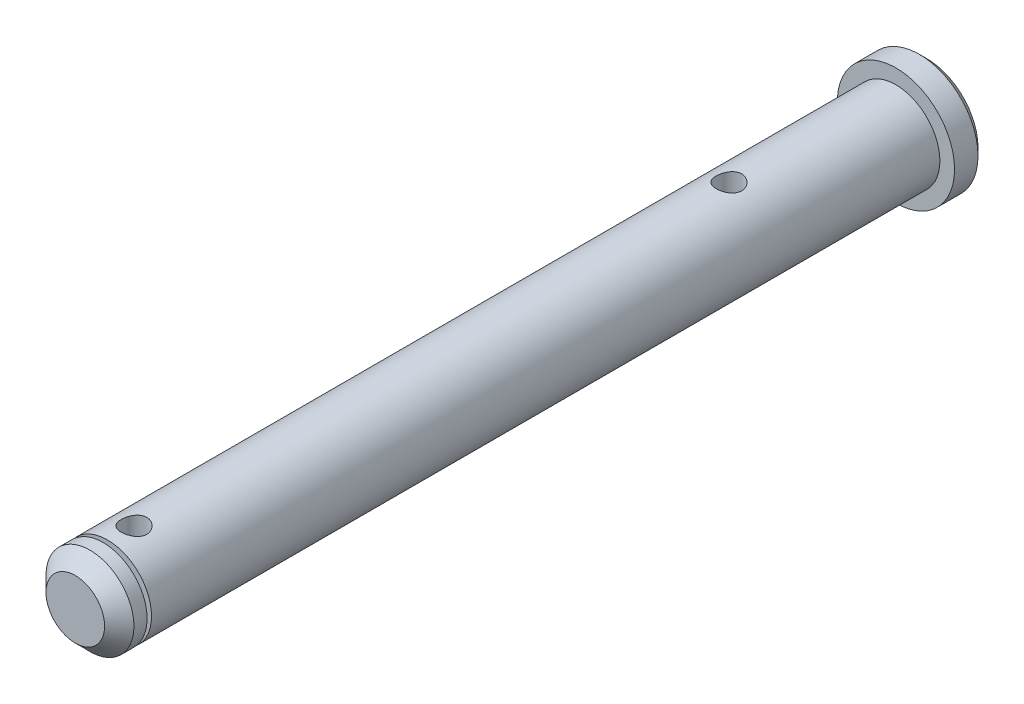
ISO-10303-21;
HEADER;
FILE_DESCRIPTION(('STEP AP214'),'2;1');
FILE_NAME('part.step','',(''),(''),'','','');
FILE_SCHEMA(('AUTOMOTIVE_DESIGN { 1 0 10303 214 1 1 1 1 }'));
ENDSEC;
DATA;
#1=APPLICATION_CONTEXT('core data for automotive mechanical design processes');
#2=APPLICATION_PROTOCOL_DEFINITION('international standard','automotive_design',2000,#1);
#3=PRODUCT_CONTEXT('',#1,'mechanical');
#4=PRODUCT('Part','Part','',(#3));
#5=PRODUCT_RELATED_PRODUCT_CATEGORY('part','',(#4));
#6=PRODUCT_DEFINITION_FORMATION('','',#4);
#7=PRODUCT_DEFINITION_CONTEXT('part definition',#1,'design');
#8=PRODUCT_DEFINITION('design','',#6,#7);
#9=PRODUCT_DEFINITION_SHAPE('','',#8);
#10=(LENGTH_UNIT() NAMED_UNIT(*) SI_UNIT(.MILLI.,.METRE.));
#11=(NAMED_UNIT(*) PLANE_ANGLE_UNIT() SI_UNIT($,.RADIAN.));
#12=(NAMED_UNIT(*) SI_UNIT($,.STERADIAN.) SOLID_ANGLE_UNIT());
#13=UNCERTAINTY_MEASURE_WITH_UNIT(LENGTH_MEASURE(1.E-05),#10,'distance_accuracy_value','');
#14=(GEOMETRIC_REPRESENTATION_CONTEXT(3) GLOBAL_UNCERTAINTY_ASSIGNED_CONTEXT((#13)) GLOBAL_UNIT_ASSIGNED_CONTEXT((#10,
#11,#12)) REPRESENTATION_CONTEXT('',''));
#15=CARTESIAN_POINT('',(0.,0.,0.));
#16=DIRECTION('',(0.,0.,1.));
#17=DIRECTION('',(1.,0.,0.));
#18=AXIS2_PLACEMENT_3D('',#15,#16,#17);
#19=CARTESIAN_POINT('',(0.,0.,58.1));
#20=DIRECTION('',(0.,0.,-1.));
#21=DIRECTION('',(-1.,0.,0.));
#22=AXIS2_PLACEMENT_3D('',#19,#20,#21);
#23=CYLINDRICAL_SURFACE('',#22,3.);
#24=CARTESIAN_POINT('',(0.,0.,2.1));
#25=DIRECTION('',(0.,0.,1.));
#26=DIRECTION('',(1.,0.,0.));
#27=AXIS2_PLACEMENT_3D('',#24,#25,#26);
#28=CIRCLE('',#27,3.);
#29=CARTESIAN_POINT('',(3.,0.,2.1));
#30=VERTEX_POINT('',#29);
#31=EDGE_CURVE('E97',#30,#30,#28,.T.);
#32=ORIENTED_EDGE('',*,*,#31,.T.);
#33=EDGE_LOOP('',(#32));
#34=FACE_BOUND('',#33,.T.);
#35=CARTESIAN_POINT('',(0.,-3.,54.975));
#36=CARTESIAN_POINT('',(-0.0480626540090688,-2.9999994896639,54.974999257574));
#37=CARTESIAN_POINT('',(-0.0961328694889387,-2.9988338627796,54.9710267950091));
#38=CARTESIAN_POINT('',(-0.190877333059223,-2.99429763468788,54.9552771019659));
#39=CARTESIAN_POINT('',(-0.237551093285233,-2.99092627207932,54.9434971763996));
#40=CARTESIAN_POINT('',(-0.328122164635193,-2.98234868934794,54.9125564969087));
#41=CARTESIAN_POINT('',(-0.372023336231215,-2.97714508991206,54.8934062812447));
#42=CARTESIAN_POINT('',(-0.455991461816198,-2.96544622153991,54.8483107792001));
#43=CARTESIAN_POINT('',(-0.496057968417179,-2.95895080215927,54.8223647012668));
#44=CARTESIAN_POINT('',(-0.572312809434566,-2.94516512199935,54.7636674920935));
#45=CARTESIAN_POINT('',(-0.608381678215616,-2.93785925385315,54.7307648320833));
#46=CARTESIAN_POINT('',(-0.674575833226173,-2.92337099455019,54.6594116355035));
#47=CARTESIAN_POINT('',(-0.704700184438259,-2.91618862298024,54.6209602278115));
#48=CARTESIAN_POINT('',(-0.758766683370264,-2.9025969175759,54.5386051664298));
#49=CARTESIAN_POINT('',(-0.782565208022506,-2.89620705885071,54.4946037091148));
#50=CARTESIAN_POINT('',(-0.822376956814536,-2.88515615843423,54.4030069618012));
#51=CARTESIAN_POINT('',(-0.838391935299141,-2.88049472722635,54.3554124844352));
#52=CARTESIAN_POINT('',(-0.861755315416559,-2.87359072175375,54.2593176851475));
#53=CARTESIAN_POINT('',(-0.869323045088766,-2.87128706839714,54.2108751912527));
#54=CARTESIAN_POINT('',(-0.876261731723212,-2.86917752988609,54.1133576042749));
#55=CARTESIAN_POINT('',(-0.875634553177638,-2.86937107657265,54.0642826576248));
#56=CARTESIAN_POINT('',(-0.866373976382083,-2.87217979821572,53.9686576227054));
#57=CARTESIAN_POINT('',(-0.858012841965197,-2.87471261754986,53.922078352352));
#58=CARTESIAN_POINT('',(-0.833960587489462,-2.88178162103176,53.8310145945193));
#59=CARTESIAN_POINT('',(-0.818268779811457,-2.88631799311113,53.7865303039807));
#60=CARTESIAN_POINT('',(-0.779794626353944,-2.89695040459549,53.7002420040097));
#61=CARTESIAN_POINT('',(-0.756922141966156,-2.90306608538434,53.658480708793));
#62=CARTESIAN_POINT('',(-0.704798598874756,-2.91615830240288,53.5792966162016));
#63=CARTESIAN_POINT('',(-0.675546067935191,-2.92313503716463,53.5418748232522));
#64=CARTESIAN_POINT('',(-0.61013020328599,-2.93749957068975,53.4708846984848));
#65=CARTESIAN_POINT('',(-0.573740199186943,-2.94489274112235,53.4375259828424));
#66=CARTESIAN_POINT('',(-0.495790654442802,-2.95901306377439,53.3773372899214));
#67=CARTESIAN_POINT('',(-0.454230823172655,-2.96574017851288,53.3505076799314));
#68=CARTESIAN_POINT('',(-0.366755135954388,-2.97782626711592,53.3040208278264));
#69=CARTESIAN_POINT('',(-0.320814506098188,-2.98317673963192,53.2844078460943));
#70=CARTESIAN_POINT('',(-0.226094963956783,-2.99184543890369,53.2532474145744));
#71=CARTESIAN_POINT('',(-0.17731680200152,-2.99516420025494,53.2416978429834));
#72=CARTESIAN_POINT('',(-0.0800905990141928,-2.99931194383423,53.2273358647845));
#73=CARTESIAN_POINT('',(-0.0316879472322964,-3.00022191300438,53.2242391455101));
#74=CARTESIAN_POINT('',(0.0649474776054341,-2.99968590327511,53.2260769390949));
#75=CARTESIAN_POINT('',(0.11318027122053,-2.99824022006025,53.2310104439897));
#76=CARTESIAN_POINT('',(0.207048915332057,-2.99320820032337,53.2485377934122));
#77=CARTESIAN_POINT('',(0.252718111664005,-2.98966776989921,53.260967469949));
#78=CARTESIAN_POINT('',(0.341314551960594,-2.98085358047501,53.2929386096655));
#79=CARTESIAN_POINT('',(0.384241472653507,-2.97557961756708,53.3124809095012));
#80=CARTESIAN_POINT('',(0.467196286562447,-2.96370103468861,53.3586126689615));
#81=CARTESIAN_POINT('',(0.507138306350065,-2.95706939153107,53.3853494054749));
#82=CARTESIAN_POINT('',(0.58206648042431,-2.94323847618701,53.4449305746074));
#83=CARTESIAN_POINT('',(0.617051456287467,-2.93603906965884,53.4777764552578));
#84=CARTESIAN_POINT('',(0.682310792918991,-2.92157641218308,53.5499776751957));
#85=CARTESIAN_POINT('',(0.712383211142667,-2.91431939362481,53.5895171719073));
#86=CARTESIAN_POINT('',(0.765477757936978,-2.90082694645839,53.6732384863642));
#87=CARTESIAN_POINT('',(0.788500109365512,-2.89459148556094,53.7174201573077));
#88=CARTESIAN_POINT('',(0.826676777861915,-2.88392074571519,53.8090045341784));
#89=CARTESIAN_POINT('',(0.841870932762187,-2.8794763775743,53.8563895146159));
#90=CARTESIAN_POINT('',(0.864024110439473,-2.87290765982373,53.9531977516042));
#91=CARTESIAN_POINT('',(0.870985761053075,-2.87078256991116,54.0026203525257));
#92=CARTESIAN_POINT('',(0.876304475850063,-2.86916315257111,54.1000112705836));
#93=CARTESIAN_POINT('',(0.874989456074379,-2.86956856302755,54.1479602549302));
#94=CARTESIAN_POINT('',(0.864569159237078,-2.87272504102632,54.242921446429));
#95=CARTESIAN_POINT('',(0.855464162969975,-2.87547602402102,54.2899336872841));
#96=CARTESIAN_POINT('',(0.829928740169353,-2.8829483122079,54.3811830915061));
#97=CARTESIAN_POINT('',(0.813580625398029,-2.88764744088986,54.4254452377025));
#98=CARTESIAN_POINT('',(0.774086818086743,-2.89848357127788,54.5106336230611));
#99=CARTESIAN_POINT('',(0.750939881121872,-2.90462083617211,54.5515592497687));
#100=CARTESIAN_POINT('',(0.697565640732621,-2.91790717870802,54.6304460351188));
#101=CARTESIAN_POINT('',(0.667120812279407,-2.92508394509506,54.6682553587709));
#102=CARTESIAN_POINT('',(0.600412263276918,-2.9395012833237,54.7383348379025));
#103=CARTESIAN_POINT('',(0.564147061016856,-2.94674187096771,54.7706035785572));
#104=CARTESIAN_POINT('',(0.485642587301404,-2.96070619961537,54.8295547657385));
#105=CARTESIAN_POINT('',(0.443268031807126,-2.96741061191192,54.856062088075));
#106=CARTESIAN_POINT('',(0.354468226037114,-2.97932100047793,54.9015376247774));
#107=CARTESIAN_POINT('',(0.308045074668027,-2.98452774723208,54.9205097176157));
#108=CARTESIAN_POINT('',(0.218302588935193,-2.99234364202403,54.948470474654));
#109=CARTESIAN_POINT('',(0.175293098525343,-2.99519180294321,54.9583931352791));
#110=CARTESIAN_POINT('',(0.0881910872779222,-2.99902007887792,54.9716577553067));
#111=CARTESIAN_POINT('',(0.0440987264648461,-3.00000046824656,54.975000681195));
#112=CARTESIAN_POINT('',(0.,-3.,54.975));
#113=B_SPLINE_CURVE_WITH_KNOTS('',3,(#35,#36,#37,#38,#39,#40,#41,#42,#43,#44,#45,#46,#47,#48,
#49,#50,#51,#52,#53,#54,#55,#56,#57,#58,#59,#60,#61,#62,#63,#64,#65,#66,#67,#68,#69,#70,#71,#72,
#73,#74,#75,#76,#77,#78,#79,#80,#81,#82,#83,#84,#85,#86,#87,#88,#89,#90,#91,#92,#93,#94,#95,#96,
#97,#98,#99,#100,#101,#102,#103,#104,#105,#106,#107,#108,#109,#110,#111,#112),.UNSPECIFIED.,.T.,
.F.,(4,2,2,2,2,2,2,2,2,2,2,2,2,2,2,2,2,2,2,2,2,2,2,2,2,2,2,2,2,2,2,2,2,2,2,2,2,2,4),(0.,
0.144026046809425,0.288101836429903,0.431972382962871,0.575859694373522,0.723282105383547,
0.870727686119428,1.02127975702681,1.17179787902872,1.31830974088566,1.46478826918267,
1.6062987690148,1.7478225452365,1.89119912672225,2.03460882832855,2.1836624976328,
2.33272454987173,2.48268615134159,2.63260827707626,2.77742173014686,2.9222170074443,
3.06395087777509,3.20570142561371,3.35060941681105,3.49555179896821,3.64544957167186,
3.79534260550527,3.94446510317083,4.09353998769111,4.23674683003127,4.37994851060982,
4.52156297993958,4.66320338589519,4.80975114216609,4.95633626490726,5.10689458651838,
5.25737531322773,5.38954234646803,5.52168996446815),.UNSPECIFIED.);
#114=CARTESIAN_POINT('',(0.,-3.,54.975));
#115=VERTEX_POINT('',#114);
#116=EDGE_CURVE('E88',#115,#115,#113,.T.);
#117=ORIENTED_EDGE('',*,*,#116,.F.);
#118=EDGE_LOOP('',(#117));
#119=FACE_BOUND('',#118,.T.);
#120=CARTESIAN_POINT('',(0.,3.,54.975));
#121=CARTESIAN_POINT('',(0.0480626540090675,2.9999994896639,54.974999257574));
#122=CARTESIAN_POINT('',(0.0961328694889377,2.9988338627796,54.9710267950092));
#123=CARTESIAN_POINT('',(0.190877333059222,2.99429763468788,54.9552771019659));
#124=CARTESIAN_POINT('',(0.237551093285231,2.99092627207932,54.9434971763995));
#125=CARTESIAN_POINT('',(0.328122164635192,2.98234868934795,54.9125564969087));
#126=CARTESIAN_POINT('',(0.372023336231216,2.97714508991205,54.8934062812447));
#127=CARTESIAN_POINT('',(0.4559914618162,2.96544622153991,54.8483107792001));
#128=CARTESIAN_POINT('',(0.496057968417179,2.95895080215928,54.8223647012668));
#129=CARTESIAN_POINT('',(0.572312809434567,2.94516512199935,54.7636674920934));
#130=CARTESIAN_POINT('',(0.608381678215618,2.93785925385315,54.7307648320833));
#131=CARTESIAN_POINT('',(0.674575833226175,2.92337099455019,54.6594116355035));
#132=CARTESIAN_POINT('',(0.704700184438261,2.91618862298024,54.6209602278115));
#133=CARTESIAN_POINT('',(0.758766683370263,2.9025969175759,54.5386051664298));
#134=CARTESIAN_POINT('',(0.782565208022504,2.89620705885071,54.4946037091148));
#135=CARTESIAN_POINT('',(0.822376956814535,2.88515615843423,54.4030069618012));
#136=CARTESIAN_POINT('',(0.83839193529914,2.88049472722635,54.3554124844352));
#137=CARTESIAN_POINT('',(0.861755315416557,2.87359072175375,54.2593176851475));
#138=CARTESIAN_POINT('',(0.869323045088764,2.87128706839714,54.2108751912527));
#139=CARTESIAN_POINT('',(0.876261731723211,2.86917752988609,54.1133576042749));
#140=CARTESIAN_POINT('',(0.875634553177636,2.86937107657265,54.0642826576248));
#141=CARTESIAN_POINT('',(0.866373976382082,2.87217979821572,53.9686576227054));
#142=CARTESIAN_POINT('',(0.858012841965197,2.87471261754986,53.922078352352));
#143=CARTESIAN_POINT('',(0.833960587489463,2.88178162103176,53.8310145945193));
#144=CARTESIAN_POINT('',(0.818268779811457,2.88631799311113,53.7865303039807));
#145=CARTESIAN_POINT('',(0.779794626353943,2.8969504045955,53.7002420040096));
#146=CARTESIAN_POINT('',(0.756922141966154,2.90306608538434,53.658480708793));
#147=CARTESIAN_POINT('',(0.704798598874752,2.91615830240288,53.5792966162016));
#148=CARTESIAN_POINT('',(0.675546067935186,2.92313503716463,53.5418748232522));
#149=CARTESIAN_POINT('',(0.610130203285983,2.93749957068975,53.4708846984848));
#150=CARTESIAN_POINT('',(0.573740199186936,2.94489274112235,53.4375259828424));
#151=CARTESIAN_POINT('',(0.495790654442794,2.95901306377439,53.3773372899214));
#152=CARTESIAN_POINT('',(0.454230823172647,2.96574017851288,53.3505076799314));
#153=CARTESIAN_POINT('',(0.366755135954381,2.97782626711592,53.3040208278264));
#154=CARTESIAN_POINT('',(0.320814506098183,2.98317673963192,53.2844078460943));
#155=CARTESIAN_POINT('',(0.226094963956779,2.99184543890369,53.2532474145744));
#156=CARTESIAN_POINT('',(0.177316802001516,2.99516420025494,53.2416978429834));
#157=CARTESIAN_POINT('',(0.0800905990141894,2.99931194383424,53.2273358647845));
#158=CARTESIAN_POINT('',(0.0316879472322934,3.00022191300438,53.2242391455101));
#159=CARTESIAN_POINT('',(-0.0649474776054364,2.99968590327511,53.2260769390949));
#160=CARTESIAN_POINT('',(-0.113180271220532,2.99824022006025,53.2310104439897));
#161=CARTESIAN_POINT('',(-0.207048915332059,2.99320820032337,53.2485377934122));
#162=CARTESIAN_POINT('',(-0.252718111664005,2.98966776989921,53.260967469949));
#163=CARTESIAN_POINT('',(-0.341314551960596,2.98085358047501,53.2929386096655));
#164=CARTESIAN_POINT('',(-0.38424147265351,2.97557961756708,53.3124809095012));
#165=CARTESIAN_POINT('',(-0.467196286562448,2.96370103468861,53.3586126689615));
#166=CARTESIAN_POINT('',(-0.507138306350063,2.95706939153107,53.3853494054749));
#167=CARTESIAN_POINT('',(-0.582066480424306,2.94323847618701,53.4449305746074));
#168=CARTESIAN_POINT('',(-0.617051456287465,2.93603906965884,53.4777764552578));
#169=CARTESIAN_POINT('',(-0.68231079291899,2.92157641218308,53.5499776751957));
#170=CARTESIAN_POINT('',(-0.712383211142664,2.91431939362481,53.5895171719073));
#171=CARTESIAN_POINT('',(-0.765477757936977,2.90082694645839,53.6732384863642));
#172=CARTESIAN_POINT('',(-0.788500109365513,2.89459148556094,53.7174201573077));
#173=CARTESIAN_POINT('',(-0.826676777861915,2.88392074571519,53.8090045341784));
#174=CARTESIAN_POINT('',(-0.841870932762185,2.87947637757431,53.8563895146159));
#175=CARTESIAN_POINT('',(-0.864024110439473,2.87290765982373,53.9531977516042));
#176=CARTESIAN_POINT('',(-0.870985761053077,2.87078256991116,54.0026203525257));
#177=CARTESIAN_POINT('',(-0.876304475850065,2.86916315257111,54.1000112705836));
#178=CARTESIAN_POINT('',(-0.874989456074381,2.86956856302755,54.1479602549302));
#179=CARTESIAN_POINT('',(-0.86456915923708,2.87272504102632,54.242921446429));
#180=CARTESIAN_POINT('',(-0.855464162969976,2.87547602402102,54.2899336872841));
#181=CARTESIAN_POINT('',(-0.829928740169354,2.8829483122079,54.3811830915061));
#182=CARTESIAN_POINT('',(-0.81358062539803,2.88764744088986,54.4254452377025));
#183=CARTESIAN_POINT('',(-0.774086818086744,2.89848357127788,54.5106336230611));
#184=CARTESIAN_POINT('',(-0.750939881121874,2.90462083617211,54.5515592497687));
#185=CARTESIAN_POINT('',(-0.697565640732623,2.91790717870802,54.6304460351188));
#186=CARTESIAN_POINT('',(-0.667120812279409,2.92508394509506,54.6682553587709));
#187=CARTESIAN_POINT('',(-0.600412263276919,2.9395012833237,54.7383348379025));
#188=CARTESIAN_POINT('',(-0.564147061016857,2.94674187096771,54.7706035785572));
#189=CARTESIAN_POINT('',(-0.485642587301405,2.96070619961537,54.8295547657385));
#190=CARTESIAN_POINT('',(-0.443268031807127,2.96741061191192,54.856062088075));
#191=CARTESIAN_POINT('',(-0.354468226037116,2.97932100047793,54.9015376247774));
#192=CARTESIAN_POINT('',(-0.308045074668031,2.98452774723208,54.9205097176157));
#193=CARTESIAN_POINT('',(-0.218302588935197,2.99234364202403,54.948470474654));
#194=CARTESIAN_POINT('',(-0.175293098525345,2.99519180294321,54.9583931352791));
#195=CARTESIAN_POINT('',(-0.0881910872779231,2.99902007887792,54.9716577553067));
#196=CARTESIAN_POINT('',(-0.0440987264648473,3.00000046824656,54.975000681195));
#197=CARTESIAN_POINT('',(0.,3.,54.975));
#198=B_SPLINE_CURVE_WITH_KNOTS('',3,(#120,#121,#122,#123,#124,#125,#126,#127,#128,#129,#130,
#131,#132,#133,#134,#135,#136,#137,#138,#139,#140,#141,#142,#143,#144,#145,#146,#147,#148,#149,
#150,#151,#152,#153,#154,#155,#156,#157,#158,#159,#160,#161,#162,#163,#164,#165,#166,#167,#168,
#169,#170,#171,#172,#173,#174,#175,#176,#177,#178,#179,#180,#181,#182,#183,#184,#185,#186,#187,
#188,#189,#190,#191,#192,#193,#194,#195,#196,#197),.UNSPECIFIED.,.T.,.F.,(4,2,2,2,2,2,2,2,2,2,2,
2,2,2,2,2,2,2,2,2,2,2,2,2,2,2,2,2,2,2,2,2,2,2,2,2,2,2,4),(0.,0.144026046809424,
0.288101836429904,0.431972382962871,0.575859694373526,0.723282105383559,0.870727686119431,
1.0212797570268,1.17179787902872,1.31830974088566,1.46478826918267,1.60629876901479,
1.74782254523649,1.89119912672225,2.03460882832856,2.18366249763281,2.33272454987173,
2.48268615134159,2.63260827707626,2.77742173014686,2.9222170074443,3.0639508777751,
3.20570142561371,3.35060941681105,3.4955517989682,3.64544957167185,3.79534260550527,
3.94446510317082,4.09353998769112,4.23674683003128,4.37994851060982,4.52156297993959,
4.66320338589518,4.80975114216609,4.95633626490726,5.10689458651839,5.25737531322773,
5.38954234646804,5.52168996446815),.UNSPECIFIED.);
#199=CARTESIAN_POINT('',(0.,3.,54.975));
#200=VERTEX_POINT('',#199);
#201=EDGE_CURVE('E60',#200,#200,#198,.T.);
#202=ORIENTED_EDGE('',*,*,#201,.F.);
#203=EDGE_LOOP('',(#202));
#204=FACE_BOUND('',#203,.T.);
#205=CARTESIAN_POINT('',(0.,-3.,14.375));
#206=CARTESIAN_POINT('',(-0.0480626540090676,-2.9999994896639,14.374999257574));
#207=CARTESIAN_POINT('',(-0.0961328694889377,-2.9988338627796,14.3710267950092));
#208=CARTESIAN_POINT('',(-0.190877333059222,-2.99429763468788,14.3552771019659));
#209=CARTESIAN_POINT('',(-0.237551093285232,-2.99092627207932,14.3434971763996));
#210=CARTESIAN_POINT('',(-0.328122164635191,-2.98234868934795,14.3125564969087));
#211=CARTESIAN_POINT('',(-0.372023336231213,-2.97714508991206,14.2934062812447));
#212=CARTESIAN_POINT('',(-0.455991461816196,-2.96544622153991,14.2483107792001));
#213=CARTESIAN_POINT('',(-0.496057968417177,-2.95895080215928,14.2223647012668));
#214=CARTESIAN_POINT('',(-0.572312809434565,-2.94516512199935,14.1636674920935));
#215=CARTESIAN_POINT('',(-0.608381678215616,-2.93785925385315,14.1307648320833));
#216=CARTESIAN_POINT('',(-0.674575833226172,-2.92337099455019,14.0594116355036));
#217=CARTESIAN_POINT('',(-0.704700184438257,-2.91618862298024,14.0209602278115));
#218=CARTESIAN_POINT('',(-0.75876668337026,-2.9025969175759,13.9386051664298));
#219=CARTESIAN_POINT('',(-0.782565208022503,-2.89620705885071,13.8946037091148));
#220=CARTESIAN_POINT('',(-0.822376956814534,-2.88515615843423,13.8030069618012));
#221=CARTESIAN_POINT('',(-0.83839193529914,-2.88049472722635,13.7554124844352));
#222=CARTESIAN_POINT('',(-0.861755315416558,-2.87359072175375,13.6593176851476));
#223=CARTESIAN_POINT('',(-0.869323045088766,-2.87128706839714,13.6108751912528));
#224=CARTESIAN_POINT('',(-0.876261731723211,-2.86917752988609,13.5133576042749));
#225=CARTESIAN_POINT('',(-0.875634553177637,-2.86937107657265,13.4642826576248));
#226=CARTESIAN_POINT('',(-0.866373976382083,-2.87217979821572,13.3686576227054));
#227=CARTESIAN_POINT('',(-0.858012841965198,-2.87471261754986,13.322078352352));
#228=CARTESIAN_POINT('',(-0.833960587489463,-2.88178162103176,13.2310145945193));
#229=CARTESIAN_POINT('',(-0.818268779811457,-2.88631799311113,13.1865303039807));
#230=CARTESIAN_POINT('',(-0.779794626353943,-2.8969504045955,13.1002420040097));
#231=CARTESIAN_POINT('',(-0.756922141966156,-2.90306608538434,13.0584807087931));
#232=CARTESIAN_POINT('',(-0.704798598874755,-2.91615830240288,12.9792966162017));
#233=CARTESIAN_POINT('',(-0.675546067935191,-2.92313503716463,12.9418748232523));
#234=CARTESIAN_POINT('',(-0.610130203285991,-2.93749957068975,12.8708846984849));
#235=CARTESIAN_POINT('',(-0.573740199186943,-2.94489274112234,12.8375259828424));
#236=CARTESIAN_POINT('',(-0.495790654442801,-2.95901306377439,12.7773372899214));
#237=CARTESIAN_POINT('',(-0.454230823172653,-2.96574017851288,12.7505076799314));
#238=CARTESIAN_POINT('',(-0.366755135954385,-2.97782626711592,12.7040208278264));
#239=CARTESIAN_POINT('',(-0.320814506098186,-2.98317673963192,12.6844078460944));
#240=CARTESIAN_POINT('',(-0.226094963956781,-2.99184543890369,12.6532474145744));
#241=CARTESIAN_POINT('',(-0.177316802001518,-2.99516420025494,12.6416978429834));
#242=CARTESIAN_POINT('',(-0.08009059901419,-2.99931194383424,12.6273358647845));
#243=CARTESIAN_POINT('',(-0.031687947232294,-3.00022191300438,12.6242391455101));
#244=CARTESIAN_POINT('',(0.0649474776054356,-2.99968590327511,12.6260769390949));
#245=CARTESIAN_POINT('',(0.11318027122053,-2.99824022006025,12.6310104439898));
#246=CARTESIAN_POINT('',(0.207048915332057,-2.99320820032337,12.6485377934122));
#247=CARTESIAN_POINT('',(0.252718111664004,-2.98966776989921,12.660967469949));
#248=CARTESIAN_POINT('',(0.341314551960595,-2.98085358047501,12.6929386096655));
#249=CARTESIAN_POINT('',(0.384241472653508,-2.97557961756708,12.7124809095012));
#250=CARTESIAN_POINT('',(0.467196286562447,-2.96370103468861,12.7586126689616));
#251=CARTESIAN_POINT('',(0.507138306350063,-2.95706939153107,12.7853494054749));
#252=CARTESIAN_POINT('',(0.582066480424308,-2.94323847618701,12.8449305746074));
#253=CARTESIAN_POINT('',(0.617051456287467,-2.93603906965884,12.8777764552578));
#254=CARTESIAN_POINT('',(0.682310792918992,-2.92157641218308,12.9499776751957));
#255=CARTESIAN_POINT('',(0.712383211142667,-2.91431939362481,12.9895171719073));
#256=CARTESIAN_POINT('',(0.76547775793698,-2.90082694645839,13.0732384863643));
#257=CARTESIAN_POINT('',(0.788500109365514,-2.89459148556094,13.1174201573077));
#258=CARTESIAN_POINT('',(0.826676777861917,-2.88392074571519,13.2090045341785));
#259=CARTESIAN_POINT('',(0.841870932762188,-2.8794763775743,13.2563895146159));
#260=CARTESIAN_POINT('',(0.864024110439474,-2.87290765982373,13.3531977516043));
#261=CARTESIAN_POINT('',(0.870985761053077,-2.87078256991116,13.4026203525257));
#262=CARTESIAN_POINT('',(0.876304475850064,-2.86916315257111,13.5000112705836));
#263=CARTESIAN_POINT('',(0.874989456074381,-2.86956856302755,13.5479602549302));
#264=CARTESIAN_POINT('',(0.86456915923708,-2.87272504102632,13.642921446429));
#265=CARTESIAN_POINT('',(0.855464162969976,-2.87547602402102,13.6899336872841));
#266=CARTESIAN_POINT('',(0.829928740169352,-2.8829483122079,13.7811830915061));
#267=CARTESIAN_POINT('',(0.813580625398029,-2.88764744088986,13.8254452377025));
#268=CARTESIAN_POINT('',(0.774086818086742,-2.89848357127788,13.9106336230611));
#269=CARTESIAN_POINT('',(0.750939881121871,-2.90462083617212,13.9515592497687));
#270=CARTESIAN_POINT('',(0.697565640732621,-2.91790717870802,14.0304460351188));
#271=CARTESIAN_POINT('',(0.667120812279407,-2.92508394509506,14.0682553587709));
#272=CARTESIAN_POINT('',(0.600412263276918,-2.9395012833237,14.1383348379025));
#273=CARTESIAN_POINT('',(0.564147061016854,-2.94674187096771,14.1706035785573));
#274=CARTESIAN_POINT('',(0.485642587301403,-2.96070619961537,14.2295547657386));
#275=CARTESIAN_POINT('',(0.443268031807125,-2.96741061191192,14.256062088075));
#276=CARTESIAN_POINT('',(0.354468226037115,-2.97932100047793,14.3015376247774));
#277=CARTESIAN_POINT('',(0.308045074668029,-2.98452774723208,14.3205097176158));
#278=CARTESIAN_POINT('',(0.218302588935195,-2.99234364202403,14.348470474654));
#279=CARTESIAN_POINT('',(0.175293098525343,-2.99519180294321,14.3583931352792));
#280=CARTESIAN_POINT('',(0.0881910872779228,-2.99902007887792,14.3716577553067));
#281=CARTESIAN_POINT('',(0.044098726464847,-3.00000046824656,14.3750006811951));
#282=CARTESIAN_POINT('',(0.,-3.,14.375));
#283=B_SPLINE_CURVE_WITH_KNOTS('',3,(#205,#206,#207,#208,#209,#210,#211,#212,#213,#214,#215,
#216,#217,#218,#219,#220,#221,#222,#223,#224,#225,#226,#227,#228,#229,#230,#231,#232,#233,#234,
#235,#236,#237,#238,#239,#240,#241,#242,#243,#244,#245,#246,#247,#248,#249,#250,#251,#252,#253,
#254,#255,#256,#257,#258,#259,#260,#261,#262,#263,#264,#265,#266,#267,#268,#269,#270,#271,#272,
#273,#274,#275,#276,#277,#278,#279,#280,#281,#282),.UNSPECIFIED.,.T.,.F.,(4,2,2,2,2,2,2,2,2,2,2,
2,2,2,2,2,2,2,2,2,2,2,2,2,2,2,2,2,2,2,2,2,2,2,2,2,2,2,4),(0.,0.144026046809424,
0.288101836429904,0.431972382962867,0.575859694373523,0.72328210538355,0.870727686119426,
1.0212797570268,1.17179787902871,1.31830974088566,1.46478826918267,1.60629876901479,
1.7478225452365,1.89119912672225,2.03460882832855,2.1836624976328,2.33272454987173,
2.48268615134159,2.63260827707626,2.77742173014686,2.9222170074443,3.06395087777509,
3.20570142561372,3.35060941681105,3.49555179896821,3.64544957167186,3.79534260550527,
3.94446510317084,4.09353998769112,4.23674683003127,4.37994851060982,4.52156297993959,
4.66320338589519,4.8097511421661,4.95633626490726,5.10689458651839,5.25737531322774,
5.38954234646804,5.52168996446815),.UNSPECIFIED.);
#284=CARTESIAN_POINT('',(0.,-3.,14.375));
#285=VERTEX_POINT('',#284);
#286=EDGE_CURVE('E61',#285,#285,#283,.T.);
#287=ORIENTED_EDGE('',*,*,#286,.F.);
#288=EDGE_LOOP('',(#287));
#289=FACE_BOUND('',#288,.T.);
#290=CARTESIAN_POINT('',(0.,3.,14.375));
#291=CARTESIAN_POINT('',(0.0480626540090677,2.9999994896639,14.374999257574));
#292=CARTESIAN_POINT('',(0.0961328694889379,2.9988338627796,14.3710267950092));
#293=CARTESIAN_POINT('',(0.190877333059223,2.99429763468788,14.3552771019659));
#294=CARTESIAN_POINT('',(0.237551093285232,2.99092627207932,14.3434971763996));
#295=CARTESIAN_POINT('',(0.328122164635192,2.98234868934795,14.3125564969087));
#296=CARTESIAN_POINT('',(0.372023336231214,2.97714508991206,14.2934062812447));
#297=CARTESIAN_POINT('',(0.455991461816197,2.96544622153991,14.2483107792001));
#298=CARTESIAN_POINT('',(0.496057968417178,2.95895080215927,14.2223647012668));
#299=CARTESIAN_POINT('',(0.572312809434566,2.94516512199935,14.1636674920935));
#300=CARTESIAN_POINT('',(0.608381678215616,2.93785925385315,14.1307648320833));
#301=CARTESIAN_POINT('',(0.674575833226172,2.92337099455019,14.0594116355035));
#302=CARTESIAN_POINT('',(0.704700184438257,2.91618862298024,14.0209602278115));
#303=CARTESIAN_POINT('',(0.758766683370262,2.9025969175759,13.9386051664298));
#304=CARTESIAN_POINT('',(0.782565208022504,2.89620705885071,13.8946037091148));
#305=CARTESIAN_POINT('',(0.822376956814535,2.88515615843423,13.8030069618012));
#306=CARTESIAN_POINT('',(0.83839193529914,2.88049472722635,13.7554124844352));
#307=CARTESIAN_POINT('',(0.861755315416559,2.87359072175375,13.6593176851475));
#308=CARTESIAN_POINT('',(0.869323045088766,2.87128706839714,13.6108751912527));
#309=CARTESIAN_POINT('',(0.876261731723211,2.86917752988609,13.5133576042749));
#310=CARTESIAN_POINT('',(0.875634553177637,2.86937107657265,13.4642826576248));
#311=CARTESIAN_POINT('',(0.866373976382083,2.87217979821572,13.3686576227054));
#312=CARTESIAN_POINT('',(0.858012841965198,2.87471261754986,13.322078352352));
#313=CARTESIAN_POINT('',(0.833960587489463,2.88178162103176,13.2310145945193));
#314=CARTESIAN_POINT('',(0.818268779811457,2.88631799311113,13.1865303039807));
#315=CARTESIAN_POINT('',(0.779794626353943,2.89695040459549,13.1002420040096));
#316=CARTESIAN_POINT('',(0.756922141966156,2.90306608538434,13.058480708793));
#317=CARTESIAN_POINT('',(0.704798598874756,2.91615830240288,12.9792966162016));
#318=CARTESIAN_POINT('',(0.675546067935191,2.92313503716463,12.9418748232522));
#319=CARTESIAN_POINT('',(0.61013020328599,2.93749957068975,12.8708846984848));
#320=CARTESIAN_POINT('',(0.573740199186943,2.94489274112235,12.8375259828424));
#321=CARTESIAN_POINT('',(0.4957906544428,2.95901306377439,12.7773372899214));
#322=CARTESIAN_POINT('',(0.454230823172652,2.96574017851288,12.7505076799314));
#323=CARTESIAN_POINT('',(0.366755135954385,2.97782626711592,12.7040208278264));
#324=CARTESIAN_POINT('',(0.320814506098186,2.98317673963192,12.6844078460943));
#325=CARTESIAN_POINT('',(0.22609496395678,2.99184543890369,12.6532474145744));
#326=CARTESIAN_POINT('',(0.177316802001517,2.99516420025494,12.6416978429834));
#327=CARTESIAN_POINT('',(0.0800905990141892,2.99931194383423,12.6273358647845));
#328=CARTESIAN_POINT('',(0.0316879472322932,3.00022191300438,12.6242391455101));
#329=CARTESIAN_POINT('',(-0.0649474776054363,2.99968590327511,12.6260769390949));
#330=CARTESIAN_POINT('',(-0.113180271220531,2.99824022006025,12.6310104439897));
#331=CARTESIAN_POINT('',(-0.207048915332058,2.99320820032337,12.6485377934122));
#332=CARTESIAN_POINT('',(-0.252718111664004,2.98966776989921,12.660967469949));
#333=CARTESIAN_POINT('',(-0.341314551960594,2.98085358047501,12.6929386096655));
#334=CARTESIAN_POINT('',(-0.384241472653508,2.97557961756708,12.7124809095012));
#335=CARTESIAN_POINT('',(-0.467196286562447,2.96370103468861,12.7586126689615));
#336=CARTESIAN_POINT('',(-0.507138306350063,2.95706939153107,12.7853494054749));
#337=CARTESIAN_POINT('',(-0.582066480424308,2.94323847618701,12.8449305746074));
#338=CARTESIAN_POINT('',(-0.617051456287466,2.93603906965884,12.8777764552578));
#339=CARTESIAN_POINT('',(-0.682310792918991,2.92157641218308,12.9499776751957));
#340=CARTESIAN_POINT('',(-0.712383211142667,2.91431939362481,12.9895171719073));
#341=CARTESIAN_POINT('',(-0.765477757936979,2.90082694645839,13.0732384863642));
#342=CARTESIAN_POINT('',(-0.788500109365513,2.89459148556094,13.1174201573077));
#343=CARTESIAN_POINT('',(-0.826676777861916,2.88392074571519,13.2090045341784));
#344=CARTESIAN_POINT('',(-0.841870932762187,2.8794763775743,13.2563895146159));
#345=CARTESIAN_POINT('',(-0.864024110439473,2.87290765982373,13.3531977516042));
#346=CARTESIAN_POINT('',(-0.870985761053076,2.87078256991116,13.4026203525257));
#347=CARTESIAN_POINT('',(-0.876304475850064,2.86916315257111,13.5000112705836));
#348=CARTESIAN_POINT('',(-0.87498945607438,2.86956856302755,13.5479602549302));
#349=CARTESIAN_POINT('',(-0.86456915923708,2.87272504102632,13.642921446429));
#350=CARTESIAN_POINT('',(-0.855464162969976,2.87547602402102,13.6899336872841));
#351=CARTESIAN_POINT('',(-0.829928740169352,2.8829483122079,13.7811830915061));
#352=CARTESIAN_POINT('',(-0.813580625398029,2.88764744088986,13.8254452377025));
#353=CARTESIAN_POINT('',(-0.774086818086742,2.89848357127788,13.9106336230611));
#354=CARTESIAN_POINT('',(-0.750939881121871,2.90462083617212,13.9515592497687));
#355=CARTESIAN_POINT('',(-0.697565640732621,2.91790717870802,14.0304460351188));
#356=CARTESIAN_POINT('',(-0.667120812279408,2.92508394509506,14.0682553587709));
#357=CARTESIAN_POINT('',(-0.600412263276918,2.9395012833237,14.1383348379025));
#358=CARTESIAN_POINT('',(-0.564147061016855,2.94674187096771,14.1706035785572));
#359=CARTESIAN_POINT('',(-0.485642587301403,2.96070619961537,14.2295547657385));
#360=CARTESIAN_POINT('',(-0.443268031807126,2.96741061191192,14.256062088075));
#361=CARTESIAN_POINT('',(-0.354468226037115,2.97932100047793,14.3015376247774));
#362=CARTESIAN_POINT('',(-0.308045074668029,2.98452774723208,14.3205097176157));
#363=CARTESIAN_POINT('',(-0.218302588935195,2.99234364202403,14.348470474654));
#364=CARTESIAN_POINT('',(-0.175293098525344,2.99519180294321,14.3583931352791));
#365=CARTESIAN_POINT('',(-0.0881910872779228,2.99902007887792,14.3716577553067));
#366=CARTESIAN_POINT('',(-0.044098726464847,3.00000046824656,14.375000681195));
#367=CARTESIAN_POINT('',(0.,3.,14.375));
#368=B_SPLINE_CURVE_WITH_KNOTS('',3,(#290,#291,#292,#293,#294,#295,#296,#297,#298,#299,#300,
#301,#302,#303,#304,#305,#306,#307,#308,#309,#310,#311,#312,#313,#314,#315,#316,#317,#318,#319,
#320,#321,#322,#323,#324,#325,#326,#327,#328,#329,#330,#331,#332,#333,#334,#335,#336,#337,#338,
#339,#340,#341,#342,#343,#344,#345,#346,#347,#348,#349,#350,#351,#352,#353,#354,#355,#356,#357,
#358,#359,#360,#361,#362,#363,#364,#365,#366,#367),.UNSPECIFIED.,.T.,.F.,(4,2,2,2,2,2,2,2,2,2,2,
2,2,2,2,2,2,2,2,2,2,2,2,2,2,2,2,2,2,2,2,2,2,2,2,2,2,2,4),(0.,0.144026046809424,
0.288101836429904,0.431972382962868,0.575859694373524,0.72328210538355,0.870727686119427,
1.0212797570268,1.17179787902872,1.31830974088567,1.46478826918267,1.60629876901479,
1.7478225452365,1.89119912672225,2.03460882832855,2.1836624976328,2.33272454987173,
2.48268615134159,2.63260827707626,2.77742173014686,2.9222170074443,3.06395087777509,
3.20570142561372,3.35060941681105,3.4955517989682,3.64544957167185,3.79534260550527,
3.94446510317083,4.09353998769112,4.23674683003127,4.37994851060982,4.52156297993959,
4.66320338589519,4.8097511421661,4.95633626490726,5.10689458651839,5.25737531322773,
5.38954234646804,5.52168996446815),.UNSPECIFIED.);
#369=CARTESIAN_POINT('',(0.,3.,14.375));
#370=VERTEX_POINT('',#369);
#371=EDGE_CURVE('E52',#370,#370,#368,.T.);
#372=ORIENTED_EDGE('',*,*,#371,.F.);
#373=EDGE_LOOP('',(#372));
#374=FACE_BOUND('',#373,.T.);
#375=CARTESIAN_POINT('',(0.,0.,55.9));
#376=DIRECTION('',(0.,0.,1.));
#377=DIRECTION('',(1.,0.,0.));
#378=AXIS2_PLACEMENT_3D('',#375,#376,#377);
#379=CIRCLE('',#378,3.);
#380=CARTESIAN_POINT('',(3.,0.,55.9));
#381=VERTEX_POINT('',#380);
#382=EDGE_CURVE('E115',#381,#381,#379,.T.);
#383=ORIENTED_EDGE('',*,*,#382,.F.);
#384=EDGE_LOOP('',(#383));
#385=FACE_BOUND('',#384,.T.);
#386=ADVANCED_FACE('F32',(#34,#119,#204,#289,#374,#385),#23,.T.);
#387=CARTESIAN_POINT('',(0.,0.,2.1));
#388=DIRECTION('',(0.,0.,-1.));
#389=DIRECTION('',(-1.,0.,0.));
#390=AXIS2_PLACEMENT_3D('',#387,#388,#389);
#391=CYLINDRICAL_SURFACE('',#390,4.);
#392=CARTESIAN_POINT('',(0.,0.,0.499999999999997));
#393=DIRECTION('',(0.,0.,1.));
#394=DIRECTION('',(1.,0.,0.));
#395=AXIS2_PLACEMENT_3D('',#392,#393,#394);
#396=CIRCLE('',#395,4.);
#397=CARTESIAN_POINT('',(4.,0.,0.499999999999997));
#398=VERTEX_POINT('',#397);
#399=EDGE_CURVE('E47',#398,#398,#396,.T.);
#400=ORIENTED_EDGE('',*,*,#399,.T.);
#401=EDGE_LOOP('',(#400));
#402=FACE_BOUND('',#401,.T.);
#403=CARTESIAN_POINT('',(0.,0.,2.1));
#404=DIRECTION('',(0.,0.,1.));
#405=DIRECTION('',(1.,0.,0.));
#406=AXIS2_PLACEMENT_3D('',#403,#404,#405);
#407=CIRCLE('',#406,4.);
#408=CARTESIAN_POINT('',(4.,0.,2.1));
#409=VERTEX_POINT('',#408);
#410=EDGE_CURVE('E100',#409,#409,#407,.T.);
#411=ORIENTED_EDGE('',*,*,#410,.F.);
#412=EDGE_LOOP('',(#411));
#413=FACE_BOUND('',#412,.T.);
#414=ADVANCED_FACE('F123',(#402,#413),#391,.T.);
#415=CARTESIAN_POINT('',(0.,0.,2.1));
#416=DIRECTION('',(0.,0.,1.));
#417=DIRECTION('',(1.,0.,0.));
#418=AXIS2_PLACEMENT_3D('',#415,#416,#417);
#419=PLANE('',#418);
#420=ORIENTED_EDGE('',*,*,#31,.F.);
#421=EDGE_LOOP('',(#420));
#422=FACE_BOUND('',#421,.T.);
#423=ORIENTED_EDGE('',*,*,#410,.T.);
#424=EDGE_LOOP('',(#423));
#425=FACE_BOUND('',#424,.T.);
#426=ADVANCED_FACE('F127',(#422,#425),#419,.T.);
#427=CARTESIAN_POINT('',(0.,0.,0.));
#428=DIRECTION('',(0.,0.,1.));
#429=DIRECTION('',(1.,0.,0.));
#430=AXIS2_PLACEMENT_3D('',#427,#428,#429);
#431=PLANE('',#430);
#432=CARTESIAN_POINT('',(0.,0.,0.));
#433=DIRECTION('',(0.,0.,1.));
#434=DIRECTION('',(1.,0.,0.));
#435=AXIS2_PLACEMENT_3D('',#432,#433,#434);
#436=CIRCLE('',#435,3.5);
#437=CARTESIAN_POINT('',(3.5,0.,0.));
#438=VERTEX_POINT('',#437);
#439=EDGE_CURVE('E43',#438,#438,#436,.F.);
#440=ORIENTED_EDGE('',*,*,#439,.T.);
#441=EDGE_LOOP('',(#440));
#442=FACE_BOUND('',#441,.T.);
#443=ADVANCED_FACE('F83',(#442),#431,.F.);
#444=CARTESIAN_POINT('',(0.,3.,54.1));
#445=DIRECTION('',(0.,1.,0.));
#446=DIRECTION('',(0.,0.,1.));
#447=AXIS2_PLACEMENT_3D('',#444,#445,#446);
#448=CYLINDRICAL_SURFACE('',#447,0.874999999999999);
#449=ORIENTED_EDGE('',*,*,#201,.T.);
#450=EDGE_LOOP('',(#449));
#451=FACE_BOUND('',#450,.T.);
#452=ORIENTED_EDGE('',*,*,#116,.T.);
#453=EDGE_LOOP('',(#452));
#454=FACE_BOUND('',#453,.T.);
#455=ADVANCED_FACE('F76',(#451,#454),#448,.F.);
#456=CARTESIAN_POINT('',(0.,3.,13.5));
#457=DIRECTION('',(0.,1.,0.));
#458=DIRECTION('',(0.,0.,1.));
#459=AXIS2_PLACEMENT_3D('',#456,#457,#458);
#460=CYLINDRICAL_SURFACE('',#459,0.874999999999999);
#461=ORIENTED_EDGE('',*,*,#371,.T.);
#462=EDGE_LOOP('',(#461));
#463=FACE_BOUND('',#462,.T.);
#464=ORIENTED_EDGE('',*,*,#286,.T.);
#465=EDGE_LOOP('',(#464));
#466=FACE_BOUND('',#465,.T.);
#467=ADVANCED_FACE('F70',(#463,#466),#460,.F.);
#468=CARTESIAN_POINT('',(0.,0.,0.499999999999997));
#469=DIRECTION('',(0.,0.,1.));
#470=DIRECTION('',(1.,0.,0.));
#471=AXIS2_PLACEMENT_3D('',#468,#469,#470);
#472=CONICAL_SURFACE('',#471,4.,0.785398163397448);
#473=ORIENTED_EDGE('',*,*,#439,.F.);
#474=EDGE_LOOP('',(#473));
#475=FACE_BOUND('',#474,.T.);
#476=ORIENTED_EDGE('',*,*,#399,.F.);
#477=EDGE_LOOP('',(#476));
#478=FACE_BOUND('',#477,.T.);
#479=ADVANCED_FACE('F75',(#475,#478),#472,.T.);
#480=CARTESIAN_POINT('',(-3.,0.,56.2));
#481=DIRECTION('',(0.,0.,-1.));
#482=DIRECTION('',(-1.,0.,0.));
#483=AXIS2_PLACEMENT_3D('',#480,#481,#482);
#484=PLANE('',#483);
#485=CARTESIAN_POINT('',(0.,0.,56.2));
#486=DIRECTION('',(0.,0.,1.));
#487=DIRECTION('',(1.,0.,0.));
#488=AXIS2_PLACEMENT_3D('',#485,#486,#487);
#489=CIRCLE('',#488,2.5);
#490=CARTESIAN_POINT('',(2.5,0.,56.2));
#491=VERTEX_POINT('',#490);
#492=EDGE_CURVE('E109',#491,#491,#489,.T.);
#493=ORIENTED_EDGE('',*,*,#492,.T.);
#494=EDGE_LOOP('',(#493));
#495=FACE_BOUND('',#494,.T.);
#496=CARTESIAN_POINT('',(0.,0.,56.2));
#497=DIRECTION('',(0.,0.,1.));
#498=DIRECTION('',(1.,0.,0.));
#499=AXIS2_PLACEMENT_3D('',#496,#497,#498);
#500=CIRCLE('',#499,3.);
#501=CARTESIAN_POINT('',(-3.,0.,56.2));
#502=VERTEX_POINT('',#501);
#503=EDGE_CURVE('E106',#502,#502,#500,.T.);
#504=ORIENTED_EDGE('',*,*,#503,.F.);
#505=EDGE_LOOP('',(#504));
#506=FACE_BOUND('',#505,.T.);
#507=ADVANCED_FACE('F78',(#495,#506),#484,.T.);
#508=CARTESIAN_POINT('',(0.,0.,57.1));
#509=DIRECTION('',(0.,0.,1.));
#510=DIRECTION('',(1.,0.,0.));
#511=AXIS2_PLACEMENT_3D('',#508,#509,#510);
#512=CYLINDRICAL_SURFACE('',#511,2.5);
#513=CARTESIAN_POINT('',(0.,0.,55.9));
#514=DIRECTION('',(0.,0.,1.));
#515=DIRECTION('',(1.,0.,0.));
#516=AXIS2_PLACEMENT_3D('',#513,#514,#515);
#517=CIRCLE('',#516,2.5);
#518=CARTESIAN_POINT('',(2.5,0.,55.9));
#519=VERTEX_POINT('',#518);
#520=EDGE_CURVE('E112',#519,#519,#517,.T.);
#521=ORIENTED_EDGE('',*,*,#520,.T.);
#522=EDGE_LOOP('',(#521));
#523=FACE_BOUND('',#522,.T.);
#524=ORIENTED_EDGE('',*,*,#492,.F.);
#525=EDGE_LOOP('',(#524));
#526=FACE_BOUND('',#525,.T.);
#527=ADVANCED_FACE('F140',(#523,#526),#512,.T.);
#528=CARTESIAN_POINT('',(-3.,0.,55.9));
#529=DIRECTION('',(0.,0.,1.));
#530=DIRECTION('',(1.,0.,0.));
#531=AXIS2_PLACEMENT_3D('',#528,#529,#530);
#532=PLANE('',#531);
#533=ORIENTED_EDGE('',*,*,#382,.T.);
#534=EDGE_LOOP('',(#533));
#535=FACE_BOUND('',#534,.T.);
#536=ORIENTED_EDGE('',*,*,#520,.F.);
#537=EDGE_LOOP('',(#536));
#538=FACE_BOUND('',#537,.T.);
#539=ADVANCED_FACE('F119',(#535,#538),#532,.T.);
#540=CARTESIAN_POINT('',(0.,0.,58.1));
#541=DIRECTION('',(0.,0.,-1.));
#542=DIRECTION('',(-1.,0.,0.));
#543=AXIS2_PLACEMENT_3D('',#540,#541,#542);
#544=PLANE('',#543);
#545=CARTESIAN_POINT('',(0.,0.,58.1));
#546=DIRECTION('',(0.,0.,-1.));
#547=DIRECTION('',(-1.,0.,0.));
#548=AXIS2_PLACEMENT_3D('',#545,#546,#547);
#549=CIRCLE('',#548,1.99999999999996);
#550=CARTESIAN_POINT('',(-1.99999999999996,0.,58.1));
#551=VERTEX_POINT('',#550);
#552=EDGE_CURVE('E10',#551,#551,#549,.F.);
#553=ORIENTED_EDGE('',*,*,#552,.T.);
#554=EDGE_LOOP('',(#553));
#555=FACE_BOUND('',#554,.T.);
#556=ADVANCED_FACE('F85',(#555),#544,.F.);
#557=CARTESIAN_POINT('',(0.,0.,57.1));
#558=DIRECTION('',(0.,0.,-1.));
#559=DIRECTION('',(-1.,0.,0.));
#560=AXIS2_PLACEMENT_3D('',#557,#558,#559);
#561=CONICAL_SURFACE('',#560,3.,0.785398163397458);
#562=ORIENTED_EDGE('',*,*,#552,.F.);
#563=EDGE_LOOP('',(#562));
#564=FACE_BOUND('',#563,.T.);
#565=CARTESIAN_POINT('',(0.,0.,57.1));
#566=DIRECTION('',(0.,0.,-1.));
#567=DIRECTION('',(-1.,0.,0.));
#568=AXIS2_PLACEMENT_3D('',#565,#566,#567);
#569=CIRCLE('',#568,3.);
#570=CARTESIAN_POINT('',(-3.,0.,57.1));
#571=VERTEX_POINT('',#570);
#572=EDGE_CURVE('E39',#571,#571,#569,.T.);
#573=ORIENTED_EDGE('',*,*,#572,.F.);
#574=EDGE_LOOP('',(#573));
#575=FACE_BOUND('',#574,.T.);
#576=ADVANCED_FACE('F34',(#564,#575),#561,.T.);
#577=CARTESIAN_POINT('',(-3.,0.,57.1));
#578=CARTESIAN_POINT('',(-3.,0.,57.090625));
#579=CARTESIAN_POINT('',(-3.,0.,57.08125));
#580=CARTESIAN_POINT('',(-3.,0.,57.0625));
#581=CARTESIAN_POINT('',(-3.,0.,57.053125));
#582=CARTESIAN_POINT('',(-3.,0.,57.034375));
#583=CARTESIAN_POINT('',(-3.,0.,57.025));
#584=CARTESIAN_POINT('',(-3.,0.,57.00625));
#585=CARTESIAN_POINT('',(-3.,0.,56.996875));
#586=CARTESIAN_POINT('',(-3.,0.,56.978125));
#587=CARTESIAN_POINT('',(-3.,0.,56.96875));
#588=CARTESIAN_POINT('',(-3.,0.,56.95));
#589=CARTESIAN_POINT('',(-3.,0.,56.940625));
#590=CARTESIAN_POINT('',(-3.,0.,56.921875));
#591=CARTESIAN_POINT('',(-3.,0.,56.9125));
#592=CARTESIAN_POINT('',(-3.,0.,56.89375));
#593=CARTESIAN_POINT('',(-3.,0.,56.884375));
#594=CARTESIAN_POINT('',(-3.,0.,56.865625));
#595=CARTESIAN_POINT('',(-3.,0.,56.85625));
#596=CARTESIAN_POINT('',(-3.,0.,56.8375));
#597=CARTESIAN_POINT('',(-3.,0.,56.828125));
#598=CARTESIAN_POINT('',(-3.,0.,56.809375));
#599=CARTESIAN_POINT('',(-3.,0.,56.8));
#600=CARTESIAN_POINT('',(-3.,0.,56.78125));
#601=CARTESIAN_POINT('',(-3.,0.,56.771875));
#602=CARTESIAN_POINT('',(-3.,0.,56.753125));
#603=CARTESIAN_POINT('',(-3.,0.,56.74375));
#604=CARTESIAN_POINT('',(-3.,0.,56.725));
#605=CARTESIAN_POINT('',(-3.,0.,56.715625));
#606=CARTESIAN_POINT('',(-3.,0.,56.696875));
#607=CARTESIAN_POINT('',(-3.,0.,56.6875));
#608=CARTESIAN_POINT('',(-3.,0.,56.66875));
#609=CARTESIAN_POINT('',(-3.,0.,56.659375));
#610=CARTESIAN_POINT('',(-3.,0.,56.640625));
#611=CARTESIAN_POINT('',(-3.,0.,56.63125));
#612=CARTESIAN_POINT('',(-3.,0.,56.6125));
#613=CARTESIAN_POINT('',(-3.,0.,56.603125));
#614=CARTESIAN_POINT('',(-3.,0.,56.584375));
#615=CARTESIAN_POINT('',(-3.,0.,56.575));
#616=CARTESIAN_POINT('',(-3.,0.,56.55625));
#617=CARTESIAN_POINT('',(-3.,0.,56.546875));
#618=CARTESIAN_POINT('',(-3.,0.,56.528125));
#619=CARTESIAN_POINT('',(-3.,0.,56.51875));
#620=CARTESIAN_POINT('',(-3.,0.,56.5));
#621=CARTESIAN_POINT('',(-3.,0.,56.490625));
#622=CARTESIAN_POINT('',(-3.,0.,56.471875));
#623=CARTESIAN_POINT('',(-3.,0.,56.4625));
#624=CARTESIAN_POINT('',(-3.,0.,56.44375));
#625=CARTESIAN_POINT('',(-3.,0.,56.434375));
#626=CARTESIAN_POINT('',(-3.,0.,56.415625));
#627=CARTESIAN_POINT('',(-3.,0.,56.40625));
#628=CARTESIAN_POINT('',(-3.,0.,56.3875));
#629=CARTESIAN_POINT('',(-3.,0.,56.378125));
#630=CARTESIAN_POINT('',(-3.,0.,56.359375));
#631=CARTESIAN_POINT('',(-3.,0.,56.35));
#632=CARTESIAN_POINT('',(-3.,0.,56.33125));
#633=CARTESIAN_POINT('',(-3.,0.,56.321875));
#634=CARTESIAN_POINT('',(-3.,0.,56.303125));
#635=CARTESIAN_POINT('',(-3.,0.,56.29375));
#636=CARTESIAN_POINT('',(-3.,0.,56.275));
#637=CARTESIAN_POINT('',(-3.,0.,56.265625));
#638=CARTESIAN_POINT('',(-3.,0.,56.246875));
#639=CARTESIAN_POINT('',(-3.,0.,56.2375));
#640=CARTESIAN_POINT('',(-3.,0.,56.21875));
#641=CARTESIAN_POINT('',(-3.,0.,56.209375));
#642=CARTESIAN_POINT('',(-3.,0.,56.2));
#643=B_SPLINE_CURVE_WITH_KNOTS('',3,(#577,#578,#579,#580,#581,#582,#583,#584,#585,#586,#587,
#588,#589,#590,#591,#592,#593,#594,#595,#596,#597,#598,#599,#600,#601,#602,#603,#604,#605,#606,
#607,#608,#609,#610,#611,#612,#613,#614,#615,#616,#617,#618,#619,#620,#621,#622,#623,#624,#625,
#626,#627,#628,#629,#630,#631,#632,#633,#634,#635,#636,#637,#638,#639,#640,#641,#642),
.UNSPECIFIED.,.F.,.F.,(4,2,2,2,2,2,2,2,2,2,2,2,2,2,2,2,2,2,2,2,2,2,2,2,2,2,2,2,2,2,2,2,4),(0.,
0.0281249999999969,0.0562499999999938,0.0843749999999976,0.112499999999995,0.140624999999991,
0.168749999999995,0.196874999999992,0.224999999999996,0.253124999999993,0.28124999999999,
0.309374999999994,0.337499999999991,0.365624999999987,0.393749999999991,0.421874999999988,
0.449999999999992,0.478124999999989,0.506249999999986,0.53437499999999,0.562499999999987,
0.590624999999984,0.618749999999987,0.646874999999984,0.674999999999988,0.703124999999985,
0.731249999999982,0.759374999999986,0.787499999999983,0.81562499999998,0.843749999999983,
0.87187499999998,0.899999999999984),.UNSPECIFIED.);
#644=EDGE_CURVE('BSEAM66',#571,#502,#643,.T.);
#645=ORIENTED_EDGE('',*,*,#572,.T.);
#646=ORIENTED_EDGE('',*,*,#503,.T.);
#647=ORIENTED_EDGE('',*,*,#644,.T.);
#648=ORIENTED_EDGE('',*,*,#644,.F.);
#649=EDGE_LOOP('',(#645,#647,#646,#648));
#650=FACE_BOUND('',#649,.T.);
#651=ADVANCED_FACE('F66',(#650),#23,.T.);
#652=CLOSED_SHELL('',(#386,#414,#426,#443,#455,#467,#479,#507,#527,#539,#556,#576,#651));
#653=MANIFOLD_SOLID_BREP('B2',#652);
#654=ADVANCED_BREP_SHAPE_REPRESENTATION('',(#18,#653),#14);
#655=SHAPE_DEFINITION_REPRESENTATION(#9,#654);
ENDSEC;
END-ISO-10303-21;
